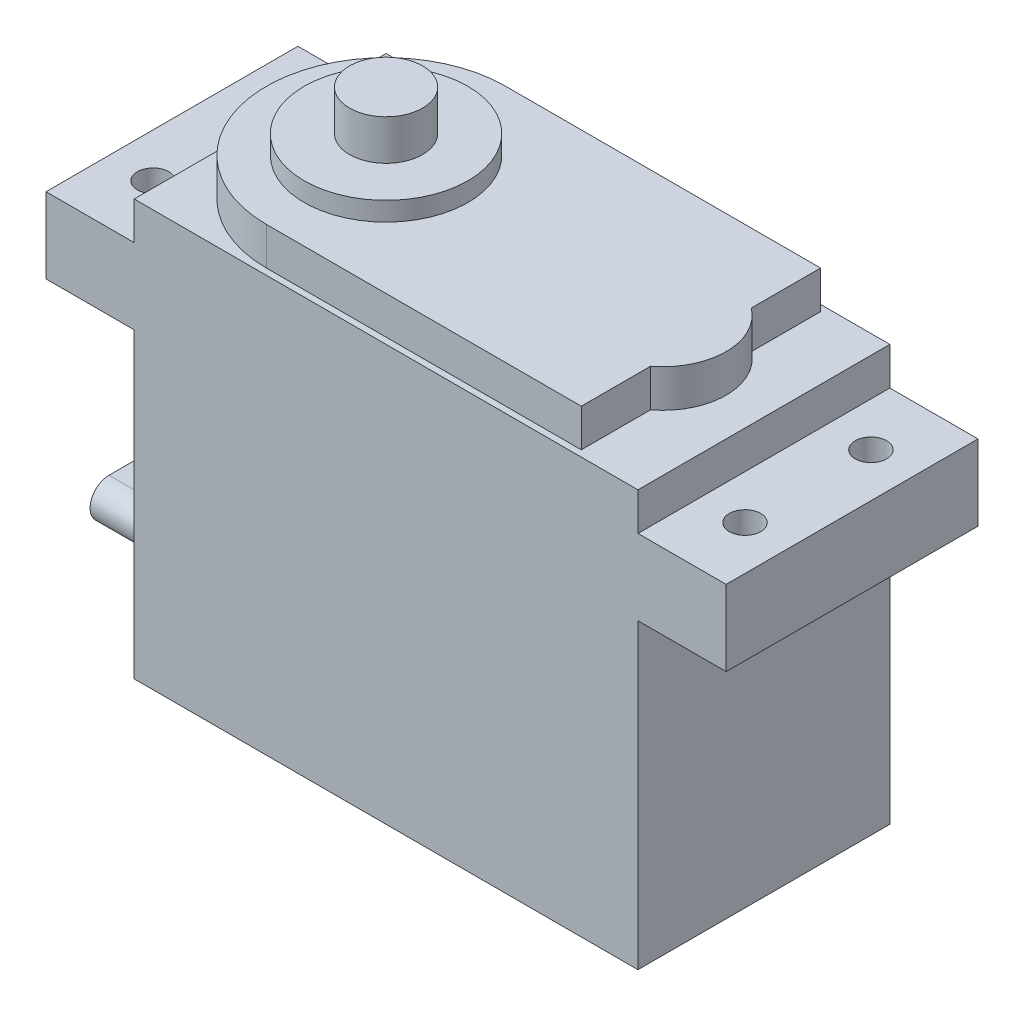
from build123d import *

# Parameters (mm, degrees)
EXTRUSION1_DEPTH        = 20
ESQUISSE2_R             = 1.25
ENL_V_MAT_EXTRU_1_DEPTH = 60.236812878
EXTRUSION2_DEPTH        = 3
ESQUISSE4_R             = 6.5
EXTRUSION3_DEPTH        = 1.5
ESQUISSE5_R             = 2.9
EXTRUSION4_DEPTH        = 3.2
EXTRUSION5_DEPTH        = 0.5
EXTRUSION6_DEPTH        = 10


with BuildPart() as part:
    # Esquisse1 → Extrusion1 (new body)
    with BuildSketch(Plane.XY):
        Polygon((47, 30), (40, 30), (40, 33), (0, 33), (0, 30), (-7, 30), (-7, 24), (0, 24), (0, 0), (40, 0), (40, 24), (47, 24), align=None)
    extrude(amount=EXTRUSION1_DEPTH)

    # Esquisse2 → Enl_v. mat.-Extru.1 (cut, through all)
    with BuildSketch(Plane(origin=(0, 30, 0), x_dir=(1, 0, 0), z_dir=(0, 1, 0))):
        with Locations(Location((-3.5, -5, 0), (0, 0, 270))):
            Circle(ESQUISSE2_R)
        with Locations(Location((-3.5, -15, 0), (0, 0, 270))):
            Circle(ESQUISSE2_R)
        with Locations(Location((43.5, -15, 0), (0, 0, 270))):
            Circle(ESQUISSE2_R)
        with Locations(Location((43.5, -5, 0), (0, 0, 270))):
            Circle(ESQUISSE2_R)
    extrude(amount=-ENL_V_MAT_EXTRU_1_DEPTH, mode=Mode.SUBTRACT)

    # Esquisse3 → Extrusion2 (add)
    with BuildSketch(Plane(origin=(0, 33, 0), x_dir=(1, 0, 0), z_dir=(0, 1, 0))):
        with BuildLine():
            Line((10, -0.5), (35, -0.5))
            Line((35, -0.5), (35, -6))
            ThreePointArc((35, -6), (37, -10), (35, -14))
            Line((35, -14), (35, -19.5))
            Line((35, -19.5), (10, -19.5))
            ThreePointArc((10, -19.5), (0.5, -10), (10, -0.5))
        make_face()
    extrude(amount=EXTRUSION2_DEPTH)

    # Esquisse4 → Extrusion3 (add)
    with BuildSketch(Plane(origin=(0, 36, 0), x_dir=(1, 0, 0), z_dir=(0, 1, 0))):
        with Locations(Location((10, -10, 0), (0, 0, 90))):
            Circle(ESQUISSE4_R)
    extrude(amount=EXTRUSION3_DEPTH)

    # Esquisse5 → Extrusion4 (add)
    with BuildSketch(Plane(origin=(0, 37.5, 0), x_dir=(1, 0, 0), z_dir=(0, 1, 0))):
        with Locations(Location((10, -10, 0), (0, 0, 270))):
            Circle(ESQUISSE5_R)
    extrude(amount=EXTRUSION4_DEPTH)

    # Esquisse6 → Extrusion5 (add)
    with BuildSketch(Plane.ZY):
        with BuildLine():
            Line((8.5, 5), (11.5, 5))
            ThreePointArc((11.5, 5), (13.5, 3), (11.5, 1))
            Line((11.5, 1), (8.5, 1))
            ThreePointArc((8.5, 1), (6.5, 3), (8.5, 5))
        make_face()
    extrude(amount=EXTRUSION5_DEPTH)

    # Esquisse7 → Extrusion6 (add)
    with BuildSketch(Plane.ZY.offset(0.5)):
        with BuildLine():
            Line((8.5, 1.5), (11.5, 1.5))
            ThreePointArc((11.5, 1.5), (13, 3), (11.5, 4.5))
            Line((11.5, 4.5), (8.5, 4.5))
            ThreePointArc((8.5, 4.5), (7, 3), (8.5, 1.5))
        make_face()
    extrude(amount=EXTRUSION6_DEPTH)


solid = part.part
